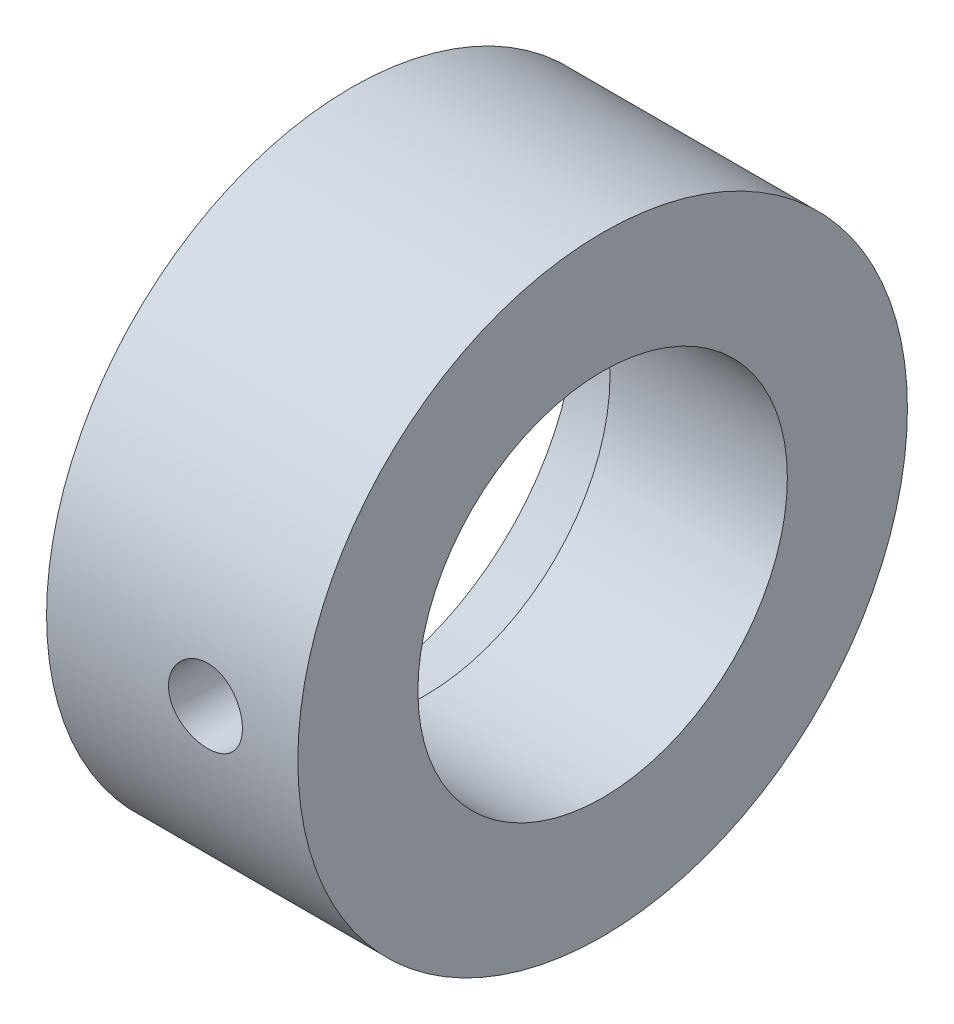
ISO-10303-21;
HEADER;
FILE_DESCRIPTION(('STEP AP214'),'2;1');
FILE_NAME('part.step','',(''),(''),'','','');
FILE_SCHEMA(('AUTOMOTIVE_DESIGN { 1 0 10303 214 1 1 1 1 }'));
ENDSEC;
DATA;
#1=APPLICATION_CONTEXT('core data for automotive mechanical design processes');
#2=APPLICATION_PROTOCOL_DEFINITION('international standard','automotive_design',2000,#1);
#3=PRODUCT_CONTEXT('',#1,'mechanical');
#4=PRODUCT('Part','Part','',(#3));
#5=PRODUCT_RELATED_PRODUCT_CATEGORY('part','',(#4));
#6=PRODUCT_DEFINITION_FORMATION('','',#4);
#7=PRODUCT_DEFINITION_CONTEXT('part definition',#1,'design');
#8=PRODUCT_DEFINITION('design','',#6,#7);
#9=PRODUCT_DEFINITION_SHAPE('','',#8);
#10=(LENGTH_UNIT() NAMED_UNIT(*) SI_UNIT(.MILLI.,.METRE.));
#11=(NAMED_UNIT(*) PLANE_ANGLE_UNIT() SI_UNIT($,.RADIAN.));
#12=(NAMED_UNIT(*) SI_UNIT($,.STERADIAN.) SOLID_ANGLE_UNIT());
#13=UNCERTAINTY_MEASURE_WITH_UNIT(LENGTH_MEASURE(1.E-05),#10,'distance_accuracy_value','');
#14=(GEOMETRIC_REPRESENTATION_CONTEXT(3) GLOBAL_UNCERTAINTY_ASSIGNED_CONTEXT((#13)) GLOBAL_UNIT_ASSIGNED_CONTEXT((#10,
#11,#12)) REPRESENTATION_CONTEXT('',''));
#15=CARTESIAN_POINT('',(0.,0.,0.));
#16=DIRECTION('',(0.,0.,1.));
#17=DIRECTION('',(1.,0.,0.));
#18=AXIS2_PLACEMENT_3D('',#15,#16,#17);
#19=CARTESIAN_POINT('',(8.58111298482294,52.5,0.));
#20=DIRECTION('',(-1.,0.,0.));
#21=DIRECTION('',(0.,0.,1.));
#22=AXIS2_PLACEMENT_3D('',#19,#20,#21);
#23=CYLINDRICAL_SURFACE('',#22,9.99999999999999);
#24=CARTESIAN_POINT('',(17.,52.5,0.));
#25=DIRECTION('',(-1.,0.,0.));
#26=DIRECTION('',(0.,0.,1.));
#27=AXIS2_PLACEMENT_3D('',#24,#25,#26);
#28=CIRCLE('',#27,9.99999999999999);
#29=CARTESIAN_POINT('',(17.,52.5,9.99999999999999));
#30=VERTEX_POINT('',#29);
#31=EDGE_CURVE('E41',#30,#30,#28,.T.);
#32=ORIENTED_EDGE('',*,*,#31,.T.);
#33=EDGE_LOOP('',(#32));
#34=FACE_BOUND('',#33,.T.);
#35=CARTESIAN_POINT('',(26.6,52.5,0.));
#36=DIRECTION('',(-1.,0.,0.));
#37=DIRECTION('',(0.,0.,1.));
#38=AXIS2_PLACEMENT_3D('',#35,#36,#37);
#39=CIRCLE('',#38,9.99999999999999);
#40=CARTESIAN_POINT('',(26.6,52.5,9.99999999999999));
#41=VERTEX_POINT('',#40);
#42=EDGE_CURVE('E45',#41,#41,#39,.T.);
#43=ORIENTED_EDGE('',*,*,#42,.F.);
#44=EDGE_LOOP('',(#43));
#45=FACE_BOUND('',#44,.T.);
#46=CARTESIAN_POINT('',(23.6,52.5,9.99999999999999));
#47=CARTESIAN_POINT('',(23.5999959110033,52.3888461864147,9.99999795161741));
#48=CARTESIAN_POINT('',(23.5907023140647,52.277640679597,9.99812770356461));
#49=CARTESIAN_POINT('',(23.5538029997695,52.058372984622,9.99084731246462));
#50=CARTESIAN_POINT('',(23.526182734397,51.9503133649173,9.98543435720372));
#51=CARTESIAN_POINT('',(23.4535174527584,51.7405393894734,9.97167298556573));
#52=CARTESIAN_POINT('',(23.4084891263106,51.6388190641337,9.96332738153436));
#53=CARTESIAN_POINT('',(23.3023355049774,51.4443840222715,9.94460796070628));
#54=CARTESIAN_POINT('',(23.2412111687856,51.3516687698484,9.93423426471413));
#55=CARTESIAN_POINT('',(23.1037230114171,51.1766130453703,9.91244330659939));
#56=CARTESIAN_POINT('',(23.0271832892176,51.094412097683,9.90101491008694));
#57=CARTESIAN_POINT('',(22.8614151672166,50.9439264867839,9.87848360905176));
#58=CARTESIAN_POINT('',(22.7721857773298,50.8756429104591,9.86738073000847));
#59=CARTESIAN_POINT('',(22.5825676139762,50.7543364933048,9.8466488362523));
#60=CARTESIAN_POINT('',(22.4820847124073,50.7014581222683,9.83703414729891));
#61=CARTESIAN_POINT('',(22.2734363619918,50.6133886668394,9.82052536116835));
#62=CARTESIAN_POINT('',(22.1652716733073,50.5781958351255,9.81363099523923));
#63=CARTESIAN_POINT('',(21.9458312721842,50.5269494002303,9.80345610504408));
#64=CARTESIAN_POINT('',(21.8346149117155,50.5106510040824,9.80012940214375));
#65=CARTESIAN_POINT('',(21.6109803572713,50.4968957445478,9.79732750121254));
#66=CARTESIAN_POINT('',(21.4985622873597,50.499436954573,9.79785190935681));
#67=CARTESIAN_POINT('',(21.277506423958,50.5230908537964,9.80265102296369));
#68=CARTESIAN_POINT('',(21.1688371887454,50.5439229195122,9.80686905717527));
#69=CARTESIAN_POINT('',(20.956567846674,50.6031242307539,9.81849092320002));
#70=CARTESIAN_POINT('',(20.852967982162,50.6414943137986,9.82589490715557));
#71=CARTESIAN_POINT('',(20.6529694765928,50.7349504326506,9.84311237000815));
#72=CARTESIAN_POINT('',(20.5566242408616,50.7901476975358,9.85294179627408));
#73=CARTESIAN_POINT('',(20.3744583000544,50.9156128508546,9.87389237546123));
#74=CARTESIAN_POINT('',(20.2886388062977,50.9858824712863,9.88501367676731));
#75=CARTESIAN_POINT('',(20.1283411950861,51.1410001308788,9.90754042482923));
#76=CARTESIAN_POINT('',(20.0540948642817,51.2260876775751,9.91894738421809));
#77=CARTESIAN_POINT('',(19.9208923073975,51.407629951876,9.94057697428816));
#78=CARTESIAN_POINT('',(19.8619362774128,51.5040848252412,9.95079958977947));
#79=CARTESIAN_POINT('',(19.760944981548,51.7058812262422,9.96893380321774));
#80=CARTESIAN_POINT('',(19.7189362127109,51.8112363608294,9.97684177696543));
#81=CARTESIAN_POINT('',(19.6532790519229,52.0277020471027,9.98942817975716));
#82=CARTESIAN_POINT('',(19.6296284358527,52.1388118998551,9.99410700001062));
#83=CARTESIAN_POINT('',(19.6016870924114,52.3616411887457,9.99965343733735));
#84=CARTESIAN_POINT('',(19.5970791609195,52.4733193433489,10.0005834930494));
#85=CARTESIAN_POINT('',(19.6064997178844,52.6958498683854,9.99870103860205));
#86=CARTESIAN_POINT('',(19.6205271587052,52.8067022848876,9.99588873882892));
#87=CARTESIAN_POINT('',(19.6665567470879,53.0234113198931,9.98687664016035));
#88=CARTESIAN_POINT('',(19.6983961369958,53.1293038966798,9.98070752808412));
#89=CARTESIAN_POINT('',(19.7789679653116,53.3342472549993,9.96567104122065));
#90=CARTESIAN_POINT('',(19.8277016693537,53.4332975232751,9.95680346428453));
#91=CARTESIAN_POINT('',(19.9413649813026,53.6230823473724,9.93719823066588));
#92=CARTESIAN_POINT('',(20.0064855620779,53.7137002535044,9.92643900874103));
#93=CARTESIAN_POINT('',(20.1508183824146,53.8828360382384,9.90429469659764));
#94=CARTESIAN_POINT('',(20.2300321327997,53.9613526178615,9.89290953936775));
#95=CARTESIAN_POINT('',(20.4017467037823,54.1052811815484,9.87058607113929));
#96=CARTESIAN_POINT('',(20.4944314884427,54.1704754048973,9.85965720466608));
#97=CARTESIAN_POINT('',(20.6896227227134,54.2843708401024,9.83968383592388));
#98=CARTESIAN_POINT('',(20.7921287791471,54.3330727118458,9.83063925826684));
#99=CARTESIAN_POINT('',(21.0035364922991,54.4123036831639,9.81553481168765));
#100=CARTESIAN_POINT('',(21.1124016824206,54.4429269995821,9.80945949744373));
#101=CARTESIAN_POINT('',(21.3338669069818,54.4854173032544,9.8009487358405));
#102=CARTESIAN_POINT('',(21.4464664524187,54.4972867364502,9.79851281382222));
#103=CARTESIAN_POINT('',(21.6700177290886,54.5018418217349,9.79758299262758));
#104=CARTESIAN_POINT('',(21.780962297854,54.4948715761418,9.79901838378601));
#105=CARTESIAN_POINT('',(22.0000632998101,54.4627046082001,9.80551146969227));
#106=CARTESIAN_POINT('',(22.1082197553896,54.4375080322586,9.81056913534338));
#107=CARTESIAN_POINT('',(22.3184554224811,54.3697571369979,9.82370528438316));
#108=CARTESIAN_POINT('',(22.4205487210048,54.3272450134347,9.8317764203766));
#109=CARTESIAN_POINT('',(22.6162074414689,54.2261092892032,9.8500342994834));
#110=CARTESIAN_POINT('',(22.7097721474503,54.1674843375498,9.86022121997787));
#111=CARTESIAN_POINT('',(22.8874311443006,54.0346118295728,9.8817792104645));
#112=CARTESIAN_POINT('',(22.9713375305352,53.9601157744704,9.89316745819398));
#113=CARTESIAN_POINT('',(23.1255724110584,53.7981287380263,9.91572163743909));
#114=CARTESIAN_POINT('',(23.1958977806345,53.7106347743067,9.92688751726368));
#115=CARTESIAN_POINT('',(23.3216692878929,53.5240352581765,9.94787664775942));
#116=CARTESIAN_POINT('',(23.3769520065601,53.4248177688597,9.95768462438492));
#117=CARTESIAN_POINT('',(23.4699722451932,53.2183327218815,9.97470250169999));
#118=CARTESIAN_POINT('',(23.507725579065,53.1110725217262,9.98191474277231));
#119=CARTESIAN_POINT('',(23.5573038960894,52.9196429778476,9.99152745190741));
#120=CARTESIAN_POINT('',(23.5732863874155,52.8365633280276,9.99468606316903));
#121=CARTESIAN_POINT('',(23.5946358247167,52.6689990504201,9.99892308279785));
#122=CARTESIAN_POINT('',(23.6000031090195,52.5845144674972,10.0000015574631));
#123=CARTESIAN_POINT('',(23.6,52.5,9.99999999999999));
#124=B_SPLINE_CURVE_WITH_KNOTS('',3,(#46,#47,#48,#49,#50,#51,#52,#53,#54,#55,#56,#57,#58,#59,
#60,#61,#62,#63,#64,#65,#66,#67,#68,#69,#70,#71,#72,#73,#74,#75,#76,#77,#78,#79,#80,#81,#82,#83,
#84,#85,#86,#87,#88,#89,#90,#91,#92,#93,#94,#95,#96,#97,#98,#99,#100,#101,#102,#103,#104,#105,
#106,#107,#108,#109,#110,#111,#112,#113,#114,#115,#116,#117,#118,#119,#120,#121,#122,#123),
.UNSPECIFIED.,.T.,.F.,(4,2,2,2,2,2,2,2,2,2,2,2,2,2,2,2,2,2,2,2,2,2,2,2,2,2,2,2,2,2,2,2,2,2,2,2,
2,2,4),(0.,0.333152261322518,0.666569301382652,0.999667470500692,1.33274580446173,
1.66986534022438,2.00701119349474,2.34722390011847,2.68740298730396,3.02312370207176,
3.35881008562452,3.68943454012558,4.02007478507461,4.35294980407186,4.68586309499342,
5.02476504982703,5.36367135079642,5.70310549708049,6.04249851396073,6.37621471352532,
6.70991215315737,7.04060907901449,7.37133078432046,7.70610132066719,8.04090776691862,
8.38081257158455,8.72070377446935,9.05880762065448,9.39686736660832,9.72879445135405,
10.0607188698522,10.3918392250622,10.7229873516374,11.0597615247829,11.3966130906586,
11.7369899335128,12.0770591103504,12.3303755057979,12.5836838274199),.UNSPECIFIED.);
#125=CARTESIAN_POINT('',(23.6,52.5,9.99999999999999));
#126=VERTEX_POINT('',#125);
#127=EDGE_CURVE('E59',#126,#126,#124,.T.);
#128=ORIENTED_EDGE('',*,*,#127,.F.);
#129=EDGE_LOOP('',(#128));
#130=FACE_BOUND('',#129,.T.);
#131=ADVANCED_FACE('F29',(#34,#45,#130),#23,.F.);
#132=CARTESIAN_POINT('',(8.58111298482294,52.5,0.));
#133=DIRECTION('',(-1.,0.,0.));
#134=DIRECTION('',(0.,0.,1.));
#135=AXIS2_PLACEMENT_3D('',#132,#133,#134);
#136=CYLINDRICAL_SURFACE('',#135,16.5);
#137=CARTESIAN_POINT('',(26.6,52.5,0.));
#138=DIRECTION('',(-1.,0.,0.));
#139=DIRECTION('',(0.,0.,1.));
#140=AXIS2_PLACEMENT_3D('',#137,#138,#139);
#141=CIRCLE('',#140,16.5);
#142=CARTESIAN_POINT('',(26.6,52.5,16.5));
#143=VERTEX_POINT('',#142);
#144=EDGE_CURVE('E50',#143,#143,#141,.T.);
#145=ORIENTED_EDGE('',*,*,#144,.T.);
#146=EDGE_LOOP('',(#145));
#147=FACE_BOUND('',#146,.T.);
#148=CARTESIAN_POINT('',(13.,52.5,0.));
#149=DIRECTION('',(-1.,0.,0.));
#150=DIRECTION('',(0.,0.,1.));
#151=AXIS2_PLACEMENT_3D('',#148,#149,#150);
#152=CIRCLE('',#151,16.5);
#153=CARTESIAN_POINT('',(13.,52.5,16.5));
#154=VERTEX_POINT('',#153);
#155=EDGE_CURVE('E53',#154,#154,#152,.T.);
#156=ORIENTED_EDGE('',*,*,#155,.F.);
#157=EDGE_LOOP('',(#156));
#158=FACE_BOUND('',#157,.T.);
#159=CARTESIAN_POINT('',(23.6,52.5,16.5));
#160=CARTESIAN_POINT('',(23.5999952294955,52.6119006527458,16.4999984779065));
#161=CARTESIAN_POINT('',(23.5905770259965,52.723871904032,16.4988496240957));
#162=CARTESIAN_POINT('',(23.5531535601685,52.9447005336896,16.4943771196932));
#163=CARTESIAN_POINT('',(23.5251287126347,53.0535545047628,16.4910511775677));
#164=CARTESIAN_POINT('',(23.4513281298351,53.2649195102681,16.4825993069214));
#165=CARTESIAN_POINT('',(23.4055641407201,53.3674346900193,16.4774745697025));
#166=CARTESIAN_POINT('',(23.2976095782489,53.563309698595,16.4659955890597));
#167=CARTESIAN_POINT('',(23.2354218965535,53.6566711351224,16.4596415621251));
#168=CARTESIAN_POINT('',(23.0960399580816,53.8320929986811,16.4463769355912));
#169=CARTESIAN_POINT('',(23.018777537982,53.914099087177,16.4394638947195));
#170=CARTESIAN_POINT('',(22.8515855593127,54.06401456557,16.4258801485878));
#171=CARTESIAN_POINT('',(22.7616553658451,54.1319232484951,16.4192094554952));
#172=CARTESIAN_POINT('',(22.57132943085,54.2519171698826,16.4068415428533));
#173=CARTESIAN_POINT('',(22.4709015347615,54.3039517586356,16.4011474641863));
#174=CARTESIAN_POINT('',(22.2626523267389,54.390396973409,16.3914094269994));
#175=CARTESIAN_POINT('',(22.1548312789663,54.4248082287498,16.3873654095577));
#176=CARTESIAN_POINT('',(21.9354190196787,54.4748654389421,16.3814085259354));
#177=CARTESIAN_POINT('',(21.8238489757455,54.4906029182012,16.3794852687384));
#178=CARTESIAN_POINT('',(21.5996360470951,54.5031490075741,16.3779558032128));
#179=CARTESIAN_POINT('',(21.4869932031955,54.4999583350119,16.378349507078));
#180=CARTESIAN_POINT('',(21.264468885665,54.4748138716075,16.3813999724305));
#181=CARTESIAN_POINT('',(21.1545758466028,54.4529607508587,16.3840445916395));
#182=CARTESIAN_POINT('',(20.9400283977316,54.3912687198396,16.3912799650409));
#183=CARTESIAN_POINT('',(20.8353740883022,54.351429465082,16.3958707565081));
#184=CARTESIAN_POINT('',(20.6339612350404,54.2547873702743,16.4064950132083));
#185=CARTESIAN_POINT('',(20.5372239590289,54.1979406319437,16.4125322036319));
#186=CARTESIAN_POINT('',(20.3546241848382,54.06892866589,16.4253661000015));
#187=CARTESIAN_POINT('',(20.2687621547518,53.9967627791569,16.4321628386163));
#188=CARTESIAN_POINT('',(20.1097657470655,53.8386024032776,16.4458040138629));
#189=CARTESIAN_POINT('',(20.0367176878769,53.7525211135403,16.4526484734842));
#190=CARTESIAN_POINT('',(19.9060943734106,53.5692727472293,16.4655725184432));
#191=CARTESIAN_POINT('',(19.8485191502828,53.4721056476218,16.4716521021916));
#192=CARTESIAN_POINT('',(19.7504763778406,53.2693784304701,16.4823648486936));
#193=CARTESIAN_POINT('',(19.7100140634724,53.1638157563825,16.4869975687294));
#194=CARTESIAN_POINT('',(19.6474133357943,52.9473259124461,16.4942905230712));
#195=CARTESIAN_POINT('',(19.6252741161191,52.8363989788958,16.4969508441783));
#196=CARTESIAN_POINT('',(19.600059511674,52.6130759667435,16.4999879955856));
#197=CARTESIAN_POINT('',(19.5968651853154,52.5006935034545,16.5003790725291));
#198=CARTESIAN_POINT('',(19.6093174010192,52.2769948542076,16.4988720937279));
#199=CARTESIAN_POINT('',(19.6249635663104,52.1656786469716,16.4969740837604));
#200=CARTESIAN_POINT('',(19.6745538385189,51.9476220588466,16.4911111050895));
#201=CARTESIAN_POINT('',(19.7084414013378,51.840868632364,16.48715252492));
#202=CARTESIAN_POINT('',(19.7934938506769,51.6345602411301,16.4776117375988));
#203=CARTESIAN_POINT('',(19.8446592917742,51.5350055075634,16.4720294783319));
#204=CARTESIAN_POINT('',(19.9631040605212,51.3453882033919,16.4598284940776));
#205=CARTESIAN_POINT('',(20.0304605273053,51.2553741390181,16.4532048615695));
#206=CARTESIAN_POINT('',(20.1792659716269,51.0878864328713,16.4396778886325));
#207=CARTESIAN_POINT('',(20.2607154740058,51.0104132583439,16.4327745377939));
#208=CARTESIAN_POINT('',(20.43591806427,50.8697859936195,16.4194223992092));
#209=CARTESIAN_POINT('',(20.5297345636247,50.8067106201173,16.4129762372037));
#210=CARTESIAN_POINT('',(20.7266995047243,50.6972127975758,16.4013110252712));
#211=CARTESIAN_POINT('',(20.8298477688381,50.6507900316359,16.3960919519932));
#212=CARTESIAN_POINT('',(21.0422916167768,50.5760433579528,16.3874895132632));
#213=CARTESIAN_POINT('',(21.1515712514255,50.5476746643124,16.384101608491));
#214=CARTESIAN_POINT('',(21.3733866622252,50.5096970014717,16.3795319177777));
#215=CARTESIAN_POINT('',(21.4859222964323,50.500087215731,16.3783500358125));
#216=CARTESIAN_POINT('',(21.7102722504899,50.499914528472,16.3783288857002));
#217=CARTESIAN_POINT('',(21.8220864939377,50.5092279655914,16.3794744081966));
#218=CARTESIAN_POINT('',(22.0425481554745,50.5463759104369,16.38394634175));
#219=CARTESIAN_POINT('',(22.1511955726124,50.5742104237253,16.387272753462));
#220=CARTESIAN_POINT('',(22.3622257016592,50.6475724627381,16.3957270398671));
#221=CARTESIAN_POINT('',(22.4646103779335,50.6930944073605,16.400854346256));
#222=CARTESIAN_POINT('',(22.6603073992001,50.8005268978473,16.4123336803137));
#223=CARTESIAN_POINT('',(22.7536196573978,50.8624376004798,16.4186857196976));
#224=CARTESIAN_POINT('',(22.9291555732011,51.0013500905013,16.4319485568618));
#225=CARTESIAN_POINT('',(23.0113060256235,51.0784440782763,16.4388626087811));
#226=CARTESIAN_POINT('',(23.1615522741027,51.2453433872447,16.4524415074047));
#227=CARTESIAN_POINT('',(23.2296447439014,51.3351517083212,16.4591062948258));
#228=CARTESIAN_POINT('',(23.3500478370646,51.5252973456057,16.4714619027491));
#229=CARTESIAN_POINT('',(23.4023010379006,51.6256712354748,16.4771491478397));
#230=CARTESIAN_POINT('',(23.4891365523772,51.8337806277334,16.4868723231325));
#231=CARTESIAN_POINT('',(23.523738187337,51.9415079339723,16.4909100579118));
#232=CARTESIAN_POINT('',(23.5659482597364,52.1248346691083,16.4958990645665));
#233=CARTESIAN_POINT('',(23.5786994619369,52.1992752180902,16.4974294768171));
#234=CARTESIAN_POINT('',(23.5957269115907,52.3491331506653,16.4994804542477));
#235=CARTESIAN_POINT('',(23.6000032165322,52.4245505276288,16.5000010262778));
#236=CARTESIAN_POINT('',(23.6,52.5,16.5));
#237=B_SPLINE_CURVE_WITH_KNOTS('',3,(#159,#160,#161,#162,#163,#164,#165,#166,#167,#168,#169,
#170,#171,#172,#173,#174,#175,#176,#177,#178,#179,#180,#181,#182,#183,#184,#185,#186,#187,#188,
#189,#190,#191,#192,#193,#194,#195,#196,#197,#198,#199,#200,#201,#202,#203,#204,#205,#206,#207,
#208,#209,#210,#211,#212,#213,#214,#215,#216,#217,#218,#219,#220,#221,#222,#223,#224,#225,#226,
#227,#228,#229,#230,#231,#232,#233,#234,#235,#236),.UNSPECIFIED.,.T.,.F.,(4,2,2,2,2,2,2,2,2,2,2,
2,2,2,2,2,2,2,2,2,2,2,2,2,2,2,2,2,2,2,2,2,2,2,2,2,2,2,4),(0.,0.335426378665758,
0.671206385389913,1.00676443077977,1.3422634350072,1.6793161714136,2.0163858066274,
2.35451994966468,2.69264201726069,3.02909993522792,3.36554510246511,3.70018677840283,
4.0348348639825,4.37035427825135,4.70588812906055,5.0436020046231,5.38131658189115,
5.7191343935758,6.05693733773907,6.39261719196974,6.72829033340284,7.06292890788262,
7.39757822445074,7.73385466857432,8.07014363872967,8.4082293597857,8.74630864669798,
9.08354597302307,9.42076861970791,9.75579463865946,10.0908207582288,10.4257412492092,
10.7606649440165,11.0976889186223,11.4347925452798,11.7731040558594,12.111044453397,
12.3372085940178,12.5633712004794),.UNSPECIFIED.);
#238=CARTESIAN_POINT('',(23.6,52.5,16.5));
#239=VERTEX_POINT('',#238);
#240=EDGE_CURVE('E33',#239,#239,#237,.T.);
#241=ORIENTED_EDGE('',*,*,#240,.F.);
#242=EDGE_LOOP('',(#241));
#243=FACE_BOUND('',#242,.T.);
#244=ADVANCED_FACE('F76',(#147,#158,#243),#136,.T.);
#245=CARTESIAN_POINT('',(13.,52.5,0.));
#246=DIRECTION('',(1.,0.,0.));
#247=DIRECTION('',(0.,0.,-1.));
#248=AXIS2_PLACEMENT_3D('',#245,#246,#247);
#249=CONICAL_SURFACE('',#248,12.15,0.349065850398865);
#250=CARTESIAN_POINT('',(17.,52.5,0.));
#251=DIRECTION('',(-1.,0.,0.));
#252=DIRECTION('',(0.,0.,1.));
#253=AXIS2_PLACEMENT_3D('',#250,#251,#252);
#254=CIRCLE('',#253,13.6058809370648);
#255=CARTESIAN_POINT('',(17.,52.5,13.6058809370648));
#256=VERTEX_POINT('',#255);
#257=EDGE_CURVE('E10',#256,#256,#254,.T.);
#258=ORIENTED_EDGE('',*,*,#257,.F.);
#259=EDGE_LOOP('',(#258));
#260=FACE_BOUND('',#259,.T.);
#261=CARTESIAN_POINT('',(13.,52.5,0.));
#262=DIRECTION('',(-1.,0.,0.));
#263=DIRECTION('',(0.,0.,1.));
#264=AXIS2_PLACEMENT_3D('',#261,#262,#263);
#265=CIRCLE('',#264,12.15);
#266=CARTESIAN_POINT('',(13.,52.5,12.15));
#267=VERTEX_POINT('',#266);
#268=EDGE_CURVE('E56',#267,#267,#265,.T.);
#269=ORIENTED_EDGE('',*,*,#268,.T.);
#270=EDGE_LOOP('',(#269));
#271=FACE_BOUND('',#270,.T.);
#272=ADVANCED_FACE('F31',(#260,#271),#249,.F.);
#273=CARTESIAN_POINT('',(17.,62.5,0.));
#274=DIRECTION('',(1.,0.,0.));
#275=DIRECTION('',(0.,0.,-1.));
#276=AXIS2_PLACEMENT_3D('',#273,#274,#275);
#277=PLANE('',#276);
#278=ORIENTED_EDGE('',*,*,#31,.F.);
#279=EDGE_LOOP('',(#278));
#280=FACE_BOUND('',#279,.T.);
#281=ORIENTED_EDGE('',*,*,#257,.T.);
#282=EDGE_LOOP('',(#281));
#283=FACE_BOUND('',#282,.T.);
#284=ADVANCED_FACE('F81',(#280,#283),#277,.F.);
#285=CARTESIAN_POINT('',(26.6,69.,0.));
#286=DIRECTION('',(-1.,0.,0.));
#287=DIRECTION('',(0.,0.,1.));
#288=AXIS2_PLACEMENT_3D('',#285,#286,#287);
#289=PLANE('',#288);
#290=ORIENTED_EDGE('',*,*,#144,.F.);
#291=EDGE_LOOP('',(#290));
#292=FACE_BOUND('',#291,.T.);
#293=ORIENTED_EDGE('',*,*,#42,.T.);
#294=EDGE_LOOP('',(#293));
#295=FACE_BOUND('',#294,.T.);
#296=ADVANCED_FACE('F74',(#292,#295),#289,.F.);
#297=CARTESIAN_POINT('',(13.,64.65,0.));
#298=DIRECTION('',(1.,0.,0.));
#299=DIRECTION('',(0.,0.,-1.));
#300=AXIS2_PLACEMENT_3D('',#297,#298,#299);
#301=PLANE('',#300);
#302=ORIENTED_EDGE('',*,*,#268,.F.);
#303=EDGE_LOOP('',(#302));
#304=FACE_BOUND('',#303,.T.);
#305=ORIENTED_EDGE('',*,*,#155,.T.);
#306=EDGE_LOOP('',(#305));
#307=FACE_BOUND('',#306,.T.);
#308=ADVANCED_FACE('F70',(#304,#307),#301,.F.);
#309=CARTESIAN_POINT('',(21.6,52.5,20.));
#310=DIRECTION('',(0.,0.,-1.));
#311=DIRECTION('',(-1.,0.,0.));
#312=AXIS2_PLACEMENT_3D('',#309,#310,#311);
#313=CYLINDRICAL_SURFACE('',#312,2.);
#314=ORIENTED_EDGE('',*,*,#240,.T.);
#315=EDGE_LOOP('',(#314));
#316=FACE_BOUND('',#315,.T.);
#317=ORIENTED_EDGE('',*,*,#127,.T.);
#318=EDGE_LOOP('',(#317));
#319=FACE_BOUND('',#318,.T.);
#320=ADVANCED_FACE('F66',(#316,#319),#313,.F.);
#321=CLOSED_SHELL('',(#131,#244,#272,#284,#296,#308,#320));
#322=MANIFOLD_SOLID_BREP('B2',#321);
#323=ADVANCED_BREP_SHAPE_REPRESENTATION('',(#18,#322),#14);
#324=SHAPE_DEFINITION_REPRESENTATION(#9,#323);
ENDSEC;
END-ISO-10303-21;
